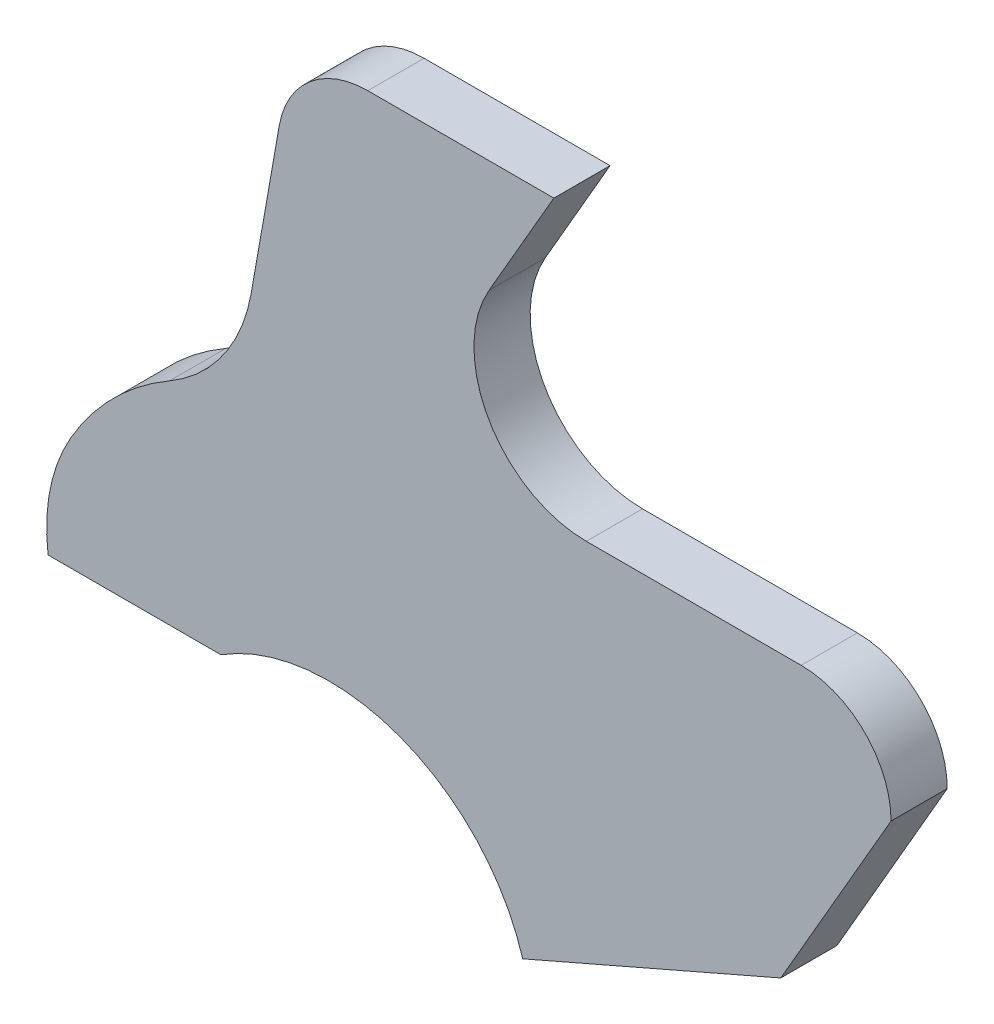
ISO-10303-21;
HEADER;
FILE_DESCRIPTION(('STEP AP214'),'2;1');
FILE_NAME('part.step','',(''),(''),'','','');
FILE_SCHEMA(('AUTOMOTIVE_DESIGN { 1 0 10303 214 1 1 1 1 }'));
ENDSEC;
DATA;
#1=APPLICATION_CONTEXT('core data for automotive mechanical design processes');
#2=APPLICATION_PROTOCOL_DEFINITION('international standard','automotive_design',2000,#1);
#3=PRODUCT_CONTEXT('',#1,'mechanical');
#4=PRODUCT('Part','Part','',(#3));
#5=PRODUCT_RELATED_PRODUCT_CATEGORY('part','',(#4));
#6=PRODUCT_DEFINITION_FORMATION('','',#4);
#7=PRODUCT_DEFINITION_CONTEXT('part definition',#1,'design');
#8=PRODUCT_DEFINITION('design','',#6,#7);
#9=PRODUCT_DEFINITION_SHAPE('','',#8);
#10=(LENGTH_UNIT() NAMED_UNIT(*) SI_UNIT(.MILLI.,.METRE.));
#11=(NAMED_UNIT(*) PLANE_ANGLE_UNIT() SI_UNIT($,.RADIAN.));
#12=(NAMED_UNIT(*) SI_UNIT($,.STERADIAN.) SOLID_ANGLE_UNIT());
#13=UNCERTAINTY_MEASURE_WITH_UNIT(LENGTH_MEASURE(1.E-05),#10,'distance_accuracy_value','');
#14=(GEOMETRIC_REPRESENTATION_CONTEXT(3) GLOBAL_UNCERTAINTY_ASSIGNED_CONTEXT((#13)) GLOBAL_UNIT_ASSIGNED_CONTEXT((#10,
#11,#12)) REPRESENTATION_CONTEXT('',''));
#15=CARTESIAN_POINT('',(0.,0.,0.));
#16=DIRECTION('',(0.,0.,1.));
#17=DIRECTION('',(1.,0.,0.));
#18=AXIS2_PLACEMENT_3D('',#15,#16,#17);
#19=CARTESIAN_POINT('',(19.2557721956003,-30.4173509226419,10.));
#20=DIRECTION('',(0.,0.,-1.));
#21=DIRECTION('',(-1.,0.,0.));
#22=AXIS2_PLACEMENT_3D('',#19,#20,#21);
#23=CYLINDRICAL_SURFACE('',#22,36.);
#24=CARTESIAN_POINT('',(19.2557721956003,-30.4173509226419,0.));
#25=DIRECTION('',(0.,0.,-1.));
#26=DIRECTION('',(-1.,0.,0.));
#27=AXIS2_PLACEMENT_3D('',#24,#25,#26);
#28=CIRCLE('',#27,36.);
#29=CARTESIAN_POINT('',(0.,0.,0.));
#30=VERTEX_POINT('',#29);
#31=CARTESIAN_POINT('',(53.7155864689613,-20.,0.));
#32=VERTEX_POINT('',#31);
#33=EDGE_CURVE('E165',#30,#32,#28,.T.);
#34=ORIENTED_EDGE('',*,*,#33,.T.);
#35=DIRECTION('',(0.,0.,-1.));
#36=VECTOR('',#35,1.);
#37=CARTESIAN_POINT('',(53.7155864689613,-20.,10.));
#38=LINE('',#37,#36);
#39=CARTESIAN_POINT('',(53.7155864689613,-20.,10.));
#40=VERTEX_POINT('',#39);
#41=EDGE_CURVE('E11',#40,#32,#38,.T.);
#42=ORIENTED_EDGE('',*,*,#41,.F.);
#43=CARTESIAN_POINT('',(19.2557721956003,-30.4173509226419,10.));
#44=DIRECTION('',(0.,0.,-1.));
#45=DIRECTION('',(-1.,0.,0.));
#46=AXIS2_PLACEMENT_3D('',#43,#44,#45);
#47=CIRCLE('',#46,36.);
#48=CARTESIAN_POINT('',(0.,0.,10.));
#49=VERTEX_POINT('',#48);
#50=EDGE_CURVE('E191',#49,#40,#47,.T.);
#51=ORIENTED_EDGE('',*,*,#50,.F.);
#52=DIRECTION('',(0.,0.,-1.));
#53=VECTOR('',#52,1.);
#54=CARTESIAN_POINT('',(0.,0.,10.));
#55=LINE('',#54,#53);
#56=EDGE_CURVE('E161',#49,#30,#55,.T.);
#57=ORIENTED_EDGE('',*,*,#56,.T.);
#58=EDGE_LOOP('',(#34,#42,#51,#57));
#59=FACE_BOUND('',#58,.T.);
#60=ADVANCED_FACE('F33',(#59),#23,.F.);
#61=CARTESIAN_POINT('',(99.625863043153,0.,10.));
#62=DIRECTION('',(-0.399381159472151,0.916784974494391,0.));
#63=DIRECTION('',(-0.916784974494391,-0.399381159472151,0.));
#64=AXIS2_PLACEMENT_3D('',#61,#62,#63);
#65=PLANE('',#64);
#66=DIRECTION('',(0.91678497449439,0.399381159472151,0.));
#67=VECTOR('',#66,1.);
#68=CARTESIAN_POINT('',(99.625863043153,0.,0.));
#69=LINE('',#68,#67);
#70=CARTESIAN_POINT('',(99.625863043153,0.,0.));
#71=VERTEX_POINT('',#70);
#72=EDGE_CURVE('E168',#32,#71,#69,.T.);
#73=ORIENTED_EDGE('',*,*,#72,.T.);
#74=DIRECTION('',(0.,0.,-1.));
#75=VECTOR('',#74,1.);
#76=CARTESIAN_POINT('',(99.625863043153,0.,10.));
#77=LINE('',#76,#75);
#78=CARTESIAN_POINT('',(99.625863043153,0.,10.));
#79=VERTEX_POINT('',#78);
#80=EDGE_CURVE('E41',#79,#71,#77,.T.);
#81=ORIENTED_EDGE('',*,*,#80,.F.);
#82=DIRECTION('',(0.91678497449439,0.399381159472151,0.));
#83=VECTOR('',#82,1.);
#84=CARTESIAN_POINT('',(99.625863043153,0.,10.));
#85=LINE('',#84,#83);
#86=EDGE_CURVE('E110',#40,#79,#85,.T.);
#87=ORIENTED_EDGE('',*,*,#86,.F.);
#88=ORIENTED_EDGE('',*,*,#41,.T.);
#89=EDGE_LOOP('',(#73,#81,#87,#88));
#90=FACE_BOUND('',#89,.T.);
#91=ADVANCED_FACE('F279',(#90),#65,.F.);
#92=CARTESIAN_POINT('',(119.2557721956,34.,10.));
#93=DIRECTION('',(-0.866025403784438,0.500000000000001,0.));
#94=DIRECTION('',(-0.500000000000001,-0.866025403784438,0.));
#95=AXIS2_PLACEMENT_3D('',#92,#93,#94);
#96=PLANE('',#95);
#97=DIRECTION('',(0.500000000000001,0.866025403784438,0.));
#98=VECTOR('',#97,1.);
#99=CARTESIAN_POINT('',(119.2557721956,34.,0.));
#100=LINE('',#99,#98);
#101=CARTESIAN_POINT('',(119.2557721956,34.,0.));
#102=VERTEX_POINT('',#101);
#103=EDGE_CURVE('E170',#71,#102,#100,.T.);
#104=ORIENTED_EDGE('',*,*,#103,.T.);
#105=DIRECTION('',(0.,0.,-1.));
#106=VECTOR('',#105,1.);
#107=CARTESIAN_POINT('',(119.2557721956,34.,10.));
#108=LINE('',#107,#106);
#109=CARTESIAN_POINT('',(119.2557721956,34.,10.));
#110=VERTEX_POINT('',#109);
#111=EDGE_CURVE('E216',#110,#102,#108,.T.);
#112=ORIENTED_EDGE('',*,*,#111,.F.);
#113=DIRECTION('',(0.500000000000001,0.866025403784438,0.));
#114=VECTOR('',#113,1.);
#115=CARTESIAN_POINT('',(119.2557721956,34.,10.));
#116=LINE('',#115,#114);
#117=EDGE_CURVE('E224',#79,#110,#116,.T.);
#118=ORIENTED_EDGE('',*,*,#117,.F.);
#119=ORIENTED_EDGE('',*,*,#80,.T.);
#120=EDGE_LOOP('',(#104,#112,#118,#119));
#121=FACE_BOUND('',#120,.T.);
#122=ADVANCED_FACE('F222',(#121),#96,.F.);
#123=CARTESIAN_POINT('',(103.2557721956,34.,10.));
#124=DIRECTION('',(0.,0.,-1.));
#125=DIRECTION('',(-1.,0.,0.));
#126=AXIS2_PLACEMENT_3D('',#123,#124,#125);
#127=CYLINDRICAL_SURFACE('',#126,16.);
#128=CARTESIAN_POINT('',(103.2557721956,34.,0.));
#129=DIRECTION('',(0.,0.,1.));
#130=DIRECTION('',(-1.,0.,0.));
#131=AXIS2_PLACEMENT_3D('',#128,#129,#130);
#132=CIRCLE('',#131,16.);
#133=CARTESIAN_POINT('',(103.2557721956,50.,0.));
#134=VERTEX_POINT('',#133);
#135=EDGE_CURVE('E172',#102,#134,#132,.T.);
#136=ORIENTED_EDGE('',*,*,#135,.T.);
#137=DIRECTION('',(0.,0.,-1.));
#138=VECTOR('',#137,1.);
#139=CARTESIAN_POINT('',(103.2557721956,50.,10.));
#140=LINE('',#139,#138);
#141=CARTESIAN_POINT('',(103.2557721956,50.,10.));
#142=VERTEX_POINT('',#141);
#143=EDGE_CURVE('E213',#142,#134,#140,.T.);
#144=ORIENTED_EDGE('',*,*,#143,.F.);
#145=CARTESIAN_POINT('',(103.2557721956,34.,10.));
#146=DIRECTION('',(0.,0.,1.));
#147=DIRECTION('',(-1.,0.,0.));
#148=AXIS2_PLACEMENT_3D('',#145,#146,#147);
#149=CIRCLE('',#148,16.);
#150=EDGE_CURVE('E242',#110,#142,#149,.T.);
#151=ORIENTED_EDGE('',*,*,#150,.F.);
#152=ORIENTED_EDGE('',*,*,#111,.T.);
#153=EDGE_LOOP('',(#136,#144,#151,#152));
#154=FACE_BOUND('',#153,.T.);
#155=ADVANCED_FACE('F233',(#154),#127,.T.);
#156=CARTESIAN_POINT('',(65.0292748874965,50.,10.));
#157=DIRECTION('',(0.,-1.,0.));
#158=DIRECTION('',(0.,0.,-1.));
#159=AXIS2_PLACEMENT_3D('',#156,#157,#158);
#160=PLANE('',#159);
#161=DIRECTION('',(-1.,0.,0.));
#162=VECTOR('',#161,1.);
#163=CARTESIAN_POINT('',(65.0292748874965,50.,0.));
#164=LINE('',#163,#162);
#165=CARTESIAN_POINT('',(65.0292748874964,50.,0.));
#166=VERTEX_POINT('',#165);
#167=EDGE_CURVE('E174',#134,#166,#164,.T.);
#168=ORIENTED_EDGE('',*,*,#167,.T.);
#169=DIRECTION('',(0.,0.,-1.));
#170=VECTOR('',#169,1.);
#171=CARTESIAN_POINT('',(65.0292748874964,50.,10.));
#172=LINE('',#171,#170);
#173=CARTESIAN_POINT('',(65.0292748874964,50.,10.));
#174=VERTEX_POINT('',#173);
#175=EDGE_CURVE('E210',#174,#166,#172,.T.);
#176=ORIENTED_EDGE('',*,*,#175,.F.);
#177=DIRECTION('',(-1.,0.,0.));
#178=VECTOR('',#177,1.);
#179=CARTESIAN_POINT('',(65.0292748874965,50.,10.));
#180=LINE('',#179,#178);
#181=EDGE_CURVE('E239',#142,#174,#180,.T.);
#182=ORIENTED_EDGE('',*,*,#181,.F.);
#183=ORIENTED_EDGE('',*,*,#143,.T.);
#184=EDGE_LOOP('',(#168,#176,#182,#183));
#185=FACE_BOUND('',#184,.T.);
#186=ADVANCED_FACE('F237',(#185),#160,.F.);
#187=CARTESIAN_POINT('',(65.0292748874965,70.,10.));
#188=DIRECTION('',(0.,0.,-1.));
#189=DIRECTION('',(-1.,0.,0.));
#190=AXIS2_PLACEMENT_3D('',#187,#188,#189);
#191=CYLINDRICAL_SURFACE('',#190,20.);
#192=CARTESIAN_POINT('',(65.0292748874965,70.,0.));
#193=DIRECTION('',(0.,0.,-1.));
#194=DIRECTION('',(1.,0.,0.));
#195=AXIS2_PLACEMENT_3D('',#192,#193,#194);
#196=CIRCLE('',#195,20.);
#197=CARTESIAN_POINT('',(47.7087668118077,80.0000000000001,0.));
#198=VERTEX_POINT('',#197);
#199=EDGE_CURVE('E176',#166,#198,#196,.T.);
#200=ORIENTED_EDGE('',*,*,#199,.T.);
#201=DIRECTION('',(0.,0.,-1.));
#202=VECTOR('',#201,1.);
#203=CARTESIAN_POINT('',(47.7087668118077,80.0000000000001,10.));
#204=LINE('',#203,#202);
#205=CARTESIAN_POINT('',(47.7087668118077,80.0000000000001,10.));
#206=VERTEX_POINT('',#205);
#207=EDGE_CURVE('E207',#206,#198,#204,.T.);
#208=ORIENTED_EDGE('',*,*,#207,.F.);
#209=CARTESIAN_POINT('',(65.0292748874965,70.,10.));
#210=DIRECTION('',(0.,0.,-1.));
#211=DIRECTION('',(1.,0.,0.));
#212=AXIS2_PLACEMENT_3D('',#209,#210,#211);
#213=CIRCLE('',#212,20.);
#214=EDGE_CURVE('E241',#174,#206,#213,.T.);
#215=ORIENTED_EDGE('',*,*,#214,.F.);
#216=ORIENTED_EDGE('',*,*,#175,.T.);
#217=EDGE_LOOP('',(#200,#208,#215,#216));
#218=FACE_BOUND('',#217,.T.);
#219=ADVANCED_FACE('F292',(#218),#191,.F.);
#220=CARTESIAN_POINT('',(59.2557721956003,100.,10.));
#221=DIRECTION('',(-0.866025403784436,0.500000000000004,0.));
#222=DIRECTION('',(-0.500000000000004,-0.866025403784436,0.));
#223=AXIS2_PLACEMENT_3D('',#220,#221,#222);
#224=PLANE('',#223);
#225=DIRECTION('',(0.500000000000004,0.866025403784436,0.));
#226=VECTOR('',#225,1.);
#227=CARTESIAN_POINT('',(59.2557721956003,100.,0.));
#228=LINE('',#227,#226);
#229=CARTESIAN_POINT('',(59.2557721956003,100.,0.));
#230=VERTEX_POINT('',#229);
#231=EDGE_CURVE('E178',#198,#230,#228,.T.);
#232=ORIENTED_EDGE('',*,*,#231,.T.);
#233=DIRECTION('',(0.,0.,-1.));
#234=VECTOR('',#233,1.);
#235=CARTESIAN_POINT('',(59.2557721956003,100.,10.));
#236=LINE('',#235,#234);
#237=CARTESIAN_POINT('',(59.2557721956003,100.,10.));
#238=VERTEX_POINT('',#237);
#239=EDGE_CURVE('E204',#238,#230,#236,.T.);
#240=ORIENTED_EDGE('',*,*,#239,.F.);
#241=DIRECTION('',(0.500000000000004,0.866025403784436,0.));
#242=VECTOR('',#241,1.);
#243=CARTESIAN_POINT('',(59.2557721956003,100.,10.));
#244=LINE('',#243,#242);
#245=EDGE_CURVE('E244',#206,#238,#244,.T.);
#246=ORIENTED_EDGE('',*,*,#245,.F.);
#247=ORIENTED_EDGE('',*,*,#207,.T.);
#248=EDGE_LOOP('',(#232,#240,#246,#247));
#249=FACE_BOUND('',#248,.T.);
#250=ADVANCED_FACE('F295',(#249),#224,.F.);
#251=CARTESIAN_POINT('',(26.1569109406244,100.,10.));
#252=DIRECTION('',(0.,-1.,0.));
#253=DIRECTION('',(1.,0.,0.));
#254=AXIS2_PLACEMENT_3D('',#251,#252,#253);
#255=PLANE('',#254);
#256=DIRECTION('',(-1.,0.,0.));
#257=VECTOR('',#256,1.);
#258=CARTESIAN_POINT('',(26.1569109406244,100.,0.));
#259=LINE('',#258,#257);
#260=CARTESIAN_POINT('',(26.1569109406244,100.,0.));
#261=VERTEX_POINT('',#260);
#262=EDGE_CURVE('E180',#230,#261,#259,.T.);
#263=ORIENTED_EDGE('',*,*,#262,.T.);
#264=DIRECTION('',(0.,0.,-1.));
#265=VECTOR('',#264,1.);
#266=CARTESIAN_POINT('',(26.1569109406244,100.,10.));
#267=LINE('',#266,#265);
#268=CARTESIAN_POINT('',(26.1569109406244,100.,10.));
#269=VERTEX_POINT('',#268);
#270=EDGE_CURVE('E201',#269,#261,#267,.T.);
#271=ORIENTED_EDGE('',*,*,#270,.F.);
#272=DIRECTION('',(-1.,0.,0.));
#273=VECTOR('',#272,1.);
#274=CARTESIAN_POINT('',(26.1569109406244,100.,10.));
#275=LINE('',#274,#273);
#276=EDGE_CURVE('E250',#238,#269,#275,.T.);
#277=ORIENTED_EDGE('',*,*,#276,.F.);
#278=ORIENTED_EDGE('',*,*,#239,.T.);
#279=EDGE_LOOP('',(#263,#271,#277,#278));
#280=FACE_BOUND('',#279,.T.);
#281=ADVANCED_FACE('F299',(#280),#255,.F.);
#282=CARTESIAN_POINT('',(26.1569109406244,84.,10.));
#283=DIRECTION('',(0.,0.,-1.));
#284=DIRECTION('',(-1.,0.,0.));
#285=AXIS2_PLACEMENT_3D('',#282,#283,#284);
#286=CYLINDRICAL_SURFACE('',#285,16.);
#287=CARTESIAN_POINT('',(26.1569109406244,84.,0.));
#288=DIRECTION('',(0.,0.,1.));
#289=DIRECTION('',(-1.,0.,0.));
#290=AXIS2_PLACEMENT_3D('',#287,#288,#289);
#291=CIRCLE('',#290,16.);
#292=CARTESIAN_POINT('',(10.399986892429,86.7783708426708,0.));
#293=VERTEX_POINT('',#292);
#294=EDGE_CURVE('E182',#261,#293,#291,.T.);
#295=ORIENTED_EDGE('',*,*,#294,.T.);
#296=DIRECTION('',(0.,0.,-1.));
#297=VECTOR('',#296,1.);
#298=CARTESIAN_POINT('',(10.399986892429,86.7783708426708,10.));
#299=LINE('',#298,#297);
#300=CARTESIAN_POINT('',(10.399986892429,86.7783708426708,10.));
#301=VERTEX_POINT('',#300);
#302=EDGE_CURVE('E198',#301,#293,#299,.T.);
#303=ORIENTED_EDGE('',*,*,#302,.F.);
#304=CARTESIAN_POINT('',(26.1569109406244,84.,10.));
#305=DIRECTION('',(0.,0.,1.));
#306=DIRECTION('',(-1.,0.,0.));
#307=AXIS2_PLACEMENT_3D('',#304,#305,#306);
#308=CIRCLE('',#307,16.);
#309=EDGE_CURVE('E252',#269,#301,#308,.T.);
#310=ORIENTED_EDGE('',*,*,#309,.F.);
#311=ORIENTED_EDGE('',*,*,#270,.T.);
#312=EDGE_LOOP('',(#295,#303,#310,#311));
#313=FACE_BOUND('',#312,.T.);
#314=ADVANCED_FACE('F303',(#313),#286,.T.);
#315=CARTESIAN_POINT('',(10.399986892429,86.7783708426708,10.));
#316=DIRECTION('',(0.984807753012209,-0.173648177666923,0.));
#317=DIRECTION('',(0.173648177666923,0.984807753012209,0.));
#318=AXIS2_PLACEMENT_3D('',#315,#316,#317);
#319=PLANE('',#318);
#320=DIRECTION('',(-0.173648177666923,-0.98480775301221,0.));
#321=VECTOR('',#320,1.);
#322=CARTESIAN_POINT('',(10.399986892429,86.7783708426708,0.));
#323=LINE('',#322,#321);
#324=CARTESIAN_POINT('',(5.39713668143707,58.4057973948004,0.));
#325=VERTEX_POINT('',#324);
#326=EDGE_CURVE('E184',#293,#325,#323,.T.);
#327=ORIENTED_EDGE('',*,*,#326,.T.);
#328=DIRECTION('',(0.,0.,-1.));
#329=VECTOR('',#328,1.);
#330=CARTESIAN_POINT('',(5.39713668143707,58.4057973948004,10.));
#331=LINE('',#330,#329);
#332=CARTESIAN_POINT('',(5.39713668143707,58.4057973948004,10.));
#333=VERTEX_POINT('',#332);
#334=EDGE_CURVE('E195',#333,#325,#331,.T.);
#335=ORIENTED_EDGE('',*,*,#334,.F.);
#336=DIRECTION('',(-0.173648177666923,-0.98480775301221,0.));
#337=VECTOR('',#336,1.);
#338=CARTESIAN_POINT('',(10.399986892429,86.7783708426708,10.));
#339=LINE('',#338,#337);
#340=EDGE_CURVE('E254',#301,#333,#339,.T.);
#341=ORIENTED_EDGE('',*,*,#340,.F.);
#342=ORIENTED_EDGE('',*,*,#302,.T.);
#343=EDGE_LOOP('',(#327,#335,#341,#342));
#344=FACE_BOUND('',#343,.T.);
#345=ADVANCED_FACE('F260',(#344),#319,.F.);
#346=CARTESIAN_POINT('',(-24.1470959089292,63.6152427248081,10.));
#347=DIRECTION('',(0.,0.,-1.));
#348=DIRECTION('',(-1.,0.,0.));
#349=AXIS2_PLACEMENT_3D('',#346,#347,#348);
#350=CYLINDRICAL_SURFACE('',#349,30.);
#351=CARTESIAN_POINT('',(-24.1470959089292,63.6152427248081,0.));
#352=DIRECTION('',(0.,0.,-1.));
#353=DIRECTION('',(-1.,0.,0.));
#354=AXIS2_PLACEMENT_3D('',#351,#352,#353);
#355=CIRCLE('',#354,30.);
#356=CARTESIAN_POINT('',(-9.14709590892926,37.6344806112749,0.));
#357=VERTEX_POINT('',#356);
#358=EDGE_CURVE('E186',#325,#357,#355,.T.);
#359=ORIENTED_EDGE('',*,*,#358,.T.);
#360=DIRECTION('',(0.,0.,-1.));
#361=VECTOR('',#360,1.);
#362=CARTESIAN_POINT('',(-9.14709590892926,37.6344806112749,10.));
#363=LINE('',#362,#361);
#364=CARTESIAN_POINT('',(-9.14709590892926,37.6344806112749,10.));
#365=VERTEX_POINT('',#364);
#366=EDGE_CURVE('E156',#365,#357,#363,.T.);
#367=ORIENTED_EDGE('',*,*,#366,.F.);
#368=CARTESIAN_POINT('',(-24.1470959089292,63.6152427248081,10.));
#369=DIRECTION('',(0.,0.,-1.));
#370=DIRECTION('',(-1.,0.,0.));
#371=AXIS2_PLACEMENT_3D('',#368,#369,#370);
#372=CIRCLE('',#371,30.);
#373=EDGE_CURVE('E147',#333,#365,#372,.T.);
#374=ORIENTED_EDGE('',*,*,#373,.F.);
#375=ORIENTED_EDGE('',*,*,#334,.T.);
#376=EDGE_LOOP('',(#359,#367,#374,#375));
#377=FACE_BOUND('',#376,.T.);
#378=ADVANCED_FACE('F264',(#377),#350,.F.);
#379=CARTESIAN_POINT('',(14.8529040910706,-3.93473877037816,10.));
#380=DIRECTION('',(0.,0.,-1.));
#381=DIRECTION('',(-1.,0.,0.));
#382=AXIS2_PLACEMENT_3D('',#379,#380,#381);
#383=CYLINDRICAL_SURFACE('',#382,48.);
#384=CARTESIAN_POINT('',(14.8529040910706,-3.93473877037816,0.));
#385=DIRECTION('',(0.,0.,1.));
#386=DIRECTION('',(-1.,0.,0.));
#387=AXIS2_PLACEMENT_3D('',#384,#385,#386);
#388=CIRCLE('',#387,48.);
#389=CARTESIAN_POINT('',(-26.7163152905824,20.0652612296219,0.));
#390=VERTEX_POINT('',#389);
#391=EDGE_CURVE('E155',#357,#390,#388,.T.);
#392=ORIENTED_EDGE('',*,*,#391,.T.);
#393=DIRECTION('',(0.,0.,-1.));
#394=VECTOR('',#393,1.);
#395=CARTESIAN_POINT('',(-26.7163152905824,20.0652612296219,10.));
#396=LINE('',#395,#394);
#397=CARTESIAN_POINT('',(-26.7163152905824,20.0652612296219,10.));
#398=VERTEX_POINT('',#397);
#399=EDGE_CURVE('E152',#398,#390,#396,.T.);
#400=ORIENTED_EDGE('',*,*,#399,.F.);
#401=CARTESIAN_POINT('',(14.8529040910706,-3.93473877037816,10.));
#402=DIRECTION('',(0.,0.,1.));
#403=DIRECTION('',(-1.,0.,0.));
#404=AXIS2_PLACEMENT_3D('',#401,#402,#403);
#405=CIRCLE('',#404,48.);
#406=EDGE_CURVE('E141',#365,#398,#405,.T.);
#407=ORIENTED_EDGE('',*,*,#406,.F.);
#408=ORIENTED_EDGE('',*,*,#366,.T.);
#409=EDGE_LOOP('',(#392,#400,#407,#408));
#410=FACE_BOUND('',#409,.T.);
#411=ADVANCED_FACE('F153',(#410),#383,.T.);
#412=CARTESIAN_POINT('',(0.996497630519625,4.06526122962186,10.));
#413=DIRECTION('',(0.,0.,-1.));
#414=DIRECTION('',(-1.,0.,0.));
#415=AXIS2_PLACEMENT_3D('',#412,#413,#414);
#416=CYLINDRICAL_SURFACE('',#415,32.);
#417=CARTESIAN_POINT('',(0.996497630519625,4.06526122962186,0.));
#418=DIRECTION('',(0.,0.,1.));
#419=DIRECTION('',(-1.,0.,0.));
#420=AXIS2_PLACEMENT_3D('',#417,#418,#419);
#421=CIRCLE('',#420,32.);
#422=CARTESIAN_POINT('',(-30.7442278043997,0.,0.));
#423=VERTEX_POINT('',#422);
#424=EDGE_CURVE('E96',#390,#423,#421,.T.);
#425=ORIENTED_EDGE('',*,*,#424,.T.);
#426=DIRECTION('',(0.,0.,-1.));
#427=VECTOR('',#426,1.);
#428=CARTESIAN_POINT('',(-30.7442278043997,0.,10.));
#429=LINE('',#428,#427);
#430=CARTESIAN_POINT('',(-30.7442278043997,0.,10.));
#431=VERTEX_POINT('',#430);
#432=EDGE_CURVE('E157',#431,#423,#429,.T.);
#433=ORIENTED_EDGE('',*,*,#432,.F.);
#434=CARTESIAN_POINT('',(0.996497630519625,4.06526122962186,10.));
#435=DIRECTION('',(0.,0.,1.));
#436=DIRECTION('',(-1.,0.,0.));
#437=AXIS2_PLACEMENT_3D('',#434,#435,#436);
#438=CIRCLE('',#437,32.);
#439=EDGE_CURVE('E145',#398,#431,#438,.T.);
#440=ORIENTED_EDGE('',*,*,#439,.F.);
#441=ORIENTED_EDGE('',*,*,#399,.T.);
#442=EDGE_LOOP('',(#425,#433,#440,#441));
#443=FACE_BOUND('',#442,.T.);
#444=ADVANCED_FACE('F159',(#443),#416,.T.);
#445=CARTESIAN_POINT('',(0.,0.,10.));
#446=DIRECTION('',(0.,1.,0.));
#447=DIRECTION('',(-1.,0.,0.));
#448=AXIS2_PLACEMENT_3D('',#445,#446,#447);
#449=PLANE('',#448);
#450=DIRECTION('',(1.,0.,0.));
#451=VECTOR('',#450,1.);
#452=CARTESIAN_POINT('',(0.,0.,0.));
#453=LINE('',#452,#451);
#454=EDGE_CURVE('E102',#423,#30,#453,.T.);
#455=ORIENTED_EDGE('',*,*,#454,.T.);
#456=ORIENTED_EDGE('',*,*,#56,.F.);
#457=DIRECTION('',(1.,0.,0.));
#458=VECTOR('',#457,1.);
#459=CARTESIAN_POINT('',(0.,0.,10.));
#460=LINE('',#459,#458);
#461=EDGE_CURVE('E49',#431,#49,#460,.T.);
#462=ORIENTED_EDGE('',*,*,#461,.F.);
#463=ORIENTED_EDGE('',*,*,#432,.T.);
#464=EDGE_LOOP('',(#455,#456,#462,#463));
#465=FACE_BOUND('',#464,.T.);
#466=ADVANCED_FACE('F268',(#465),#449,.F.);
#467=CARTESIAN_POINT('',(19.2557721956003,-30.4173509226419,10.));
#468=DIRECTION('',(0.,0.,-1.));
#469=DIRECTION('',(-1.,0.,0.));
#470=AXIS2_PLACEMENT_3D('',#467,#468,#469);
#471=PLANE('',#470);
#472=ORIENTED_EDGE('',*,*,#50,.T.);
#473=ORIENTED_EDGE('',*,*,#86,.T.);
#474=ORIENTED_EDGE('',*,*,#117,.T.);
#475=ORIENTED_EDGE('',*,*,#150,.T.);
#476=ORIENTED_EDGE('',*,*,#181,.T.);
#477=ORIENTED_EDGE('',*,*,#214,.T.);
#478=ORIENTED_EDGE('',*,*,#245,.T.);
#479=ORIENTED_EDGE('',*,*,#276,.T.);
#480=ORIENTED_EDGE('',*,*,#309,.T.);
#481=ORIENTED_EDGE('',*,*,#340,.T.);
#482=ORIENTED_EDGE('',*,*,#373,.T.);
#483=ORIENTED_EDGE('',*,*,#406,.T.);
#484=ORIENTED_EDGE('',*,*,#439,.T.);
#485=ORIENTED_EDGE('',*,*,#461,.T.);
#486=EDGE_LOOP('',(#472,#473,#474,#475,#476,#477,#478,#479,#480,#481,#482,#483,#484,#485));
#487=FACE_BOUND('',#486,.T.);
#488=ADVANCED_FACE('F143',(#487),#471,.F.);
#489=CARTESIAN_POINT('',(19.2557721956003,-30.4173509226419,0.));
#490=DIRECTION('',(0.,0.,-1.));
#491=DIRECTION('',(-1.,0.,0.));
#492=AXIS2_PLACEMENT_3D('',#489,#490,#491);
#493=PLANE('',#492);
#494=ORIENTED_EDGE('',*,*,#33,.F.);
#495=ORIENTED_EDGE('',*,*,#454,.F.);
#496=ORIENTED_EDGE('',*,*,#424,.F.);
#497=ORIENTED_EDGE('',*,*,#391,.F.);
#498=ORIENTED_EDGE('',*,*,#358,.F.);
#499=ORIENTED_EDGE('',*,*,#326,.F.);
#500=ORIENTED_EDGE('',*,*,#294,.F.);
#501=ORIENTED_EDGE('',*,*,#262,.F.);
#502=ORIENTED_EDGE('',*,*,#231,.F.);
#503=ORIENTED_EDGE('',*,*,#199,.F.);
#504=ORIENTED_EDGE('',*,*,#167,.F.);
#505=ORIENTED_EDGE('',*,*,#135,.F.);
#506=ORIENTED_EDGE('',*,*,#103,.F.);
#507=ORIENTED_EDGE('',*,*,#72,.F.);
#508=EDGE_LOOP('',(#494,#495,#496,#497,#498,#499,#500,#501,#502,#503,#504,#505,#506,#507));
#509=FACE_BOUND('',#508,.T.);
#510=ADVANCED_FACE('F228',(#509),#493,.T.);
#511=CLOSED_SHELL('',(#60,#91,#122,#155,#186,#219,#250,#281,#314,#345,#378,#411,#444,#466,#488,#510));
#512=MANIFOLD_SOLID_BREP('B2',#511);
#513=ADVANCED_BREP_SHAPE_REPRESENTATION('',(#18,#512),#14);
#514=SHAPE_DEFINITION_REPRESENTATION(#9,#513);
ENDSEC;
END-ISO-10303-21;
